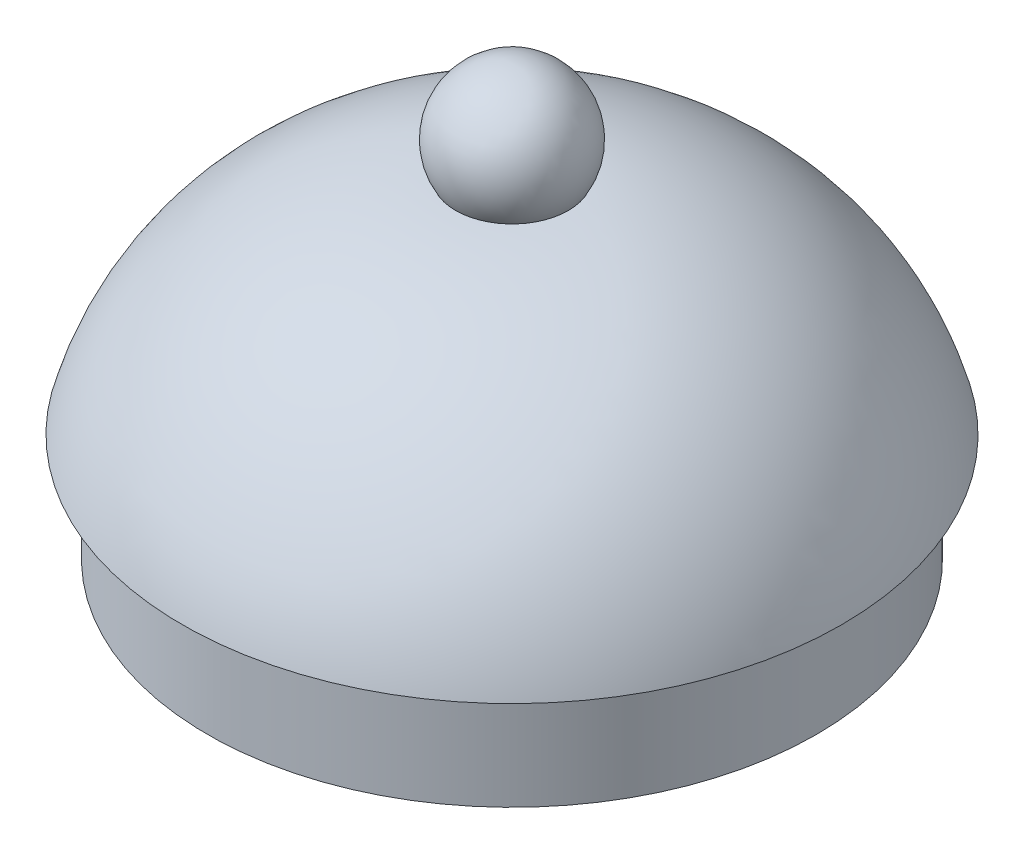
from build123d import *


with BuildPart() as part:
    # Sketch 1 → Revolve 2 (revolve)
    with BuildSketch(Plane.XY, mode=Mode.PRIVATE) as revolve_2_sk:
        with BuildLine():
            Line((0, 261.940657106), (0, 0))
            Line((0, 0), (243.44982194, 0))
            Line((243.44982194, 0), (243.44982194, 86))
            Line((243.44982194, 86), (263.50982194, 86))
            ThreePointArc((263.50982194, 86), (164.914977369, 223.634819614), (0, 261.940657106))
        make_face()
    revolve(revolve_2_sk.sketch.rotate(Axis((0, 261.940657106, 0), (0, -1, 0)), 180), axis=Axis((0, 261.940657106, 0), (0, -1, 0)))

    # Sketch 2 → Revolve 3 (revolve)
    with BuildSketch(Plane.XY, mode=Mode.PRIVATE) as revolve_3_sk:
        with BuildLine():
            Line((0, 263.660572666), (0, 342.825830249))
            ThreePointArc((0, 342.825830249), (45.548090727, 316.344913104), (45.070791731, 263.660572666))
            Line((45.070791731, 263.660572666), (0, 263.660572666))
        make_face()
    revolve(revolve_3_sk.sketch.rotate(Axis((0, 263.660572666, 0), (0, 1, 0)), 180), axis=Axis((0, 263.660572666, 0), (0, 1, 0)))


solid = part.part
